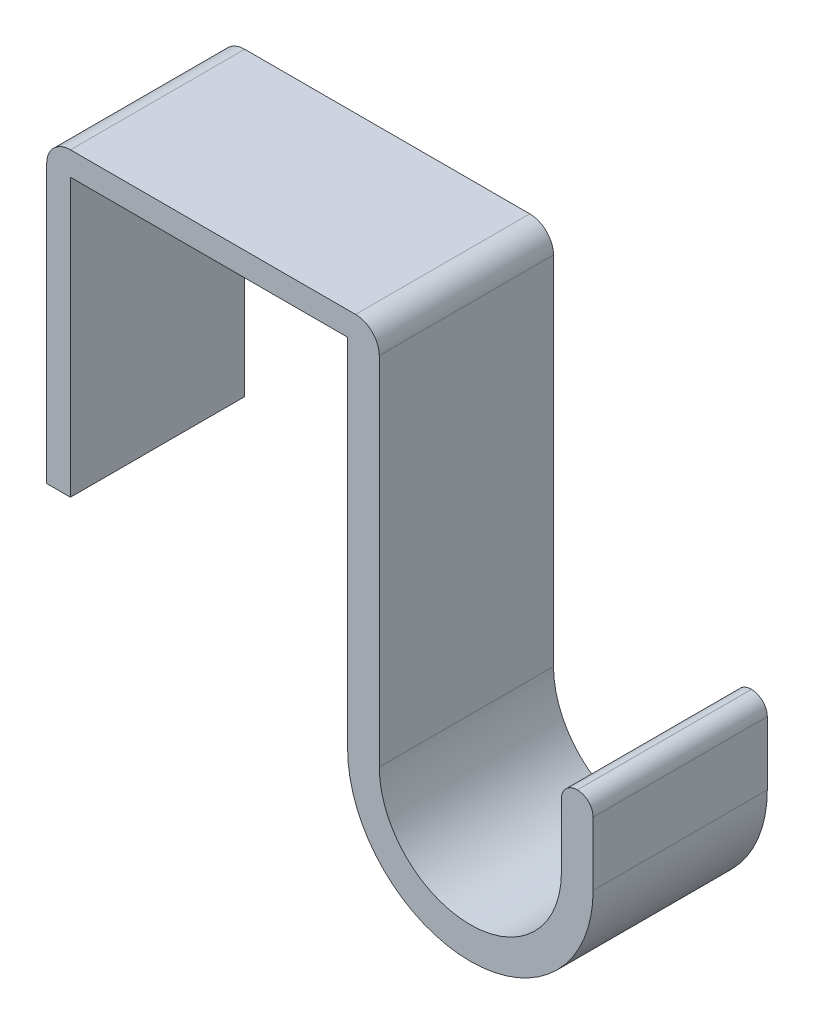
from build123d import *

# Parameters (mm, degrees)
BOSS_EXTRUDE1_DEPTH = 22


with BuildPart() as part:
    # Sketch1 → Boss-Extrude1 (new body)
    with BuildSketch(Plane.XY):
        with BuildLine():
            Line((0, 0), (-35, 0))
            Line((-35, 0), (-35, -35))
            Line((-35, -35), (-38, -35))
            Line((-38, -35), (-38, 0))
            ThreePointArc((-38, 0), (-37.121320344, 2.121320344), (-35, 3))
            Line((-35, 3), (1, 3))
            ThreePointArc((1, 3), (3.121320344, 2.121320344), (4, 0))
            Line((4, 0), (4, -45))
            ThreePointArc((4, -45), (15.5, -56.5), (27, -45))
            Line((27, -45), (27, -36.99))
            ThreePointArc((27, -36.99), (27.582857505, -35.582857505), (28.99, -35))
            Line((28.99, -35), (29.01, -35))
            ThreePointArc((29.01, -35), (30.417142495, -35.582857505), (31, -36.99))
            Line((31, -36.99), (31, -45))
            ThreePointArc((31, -45), (15.5, -60.5), (0, -45))
            Line((0, -45), (0, 0))
        make_face()
    extrude(amount=BOSS_EXTRUDE1_DEPTH)


solid = part.part
